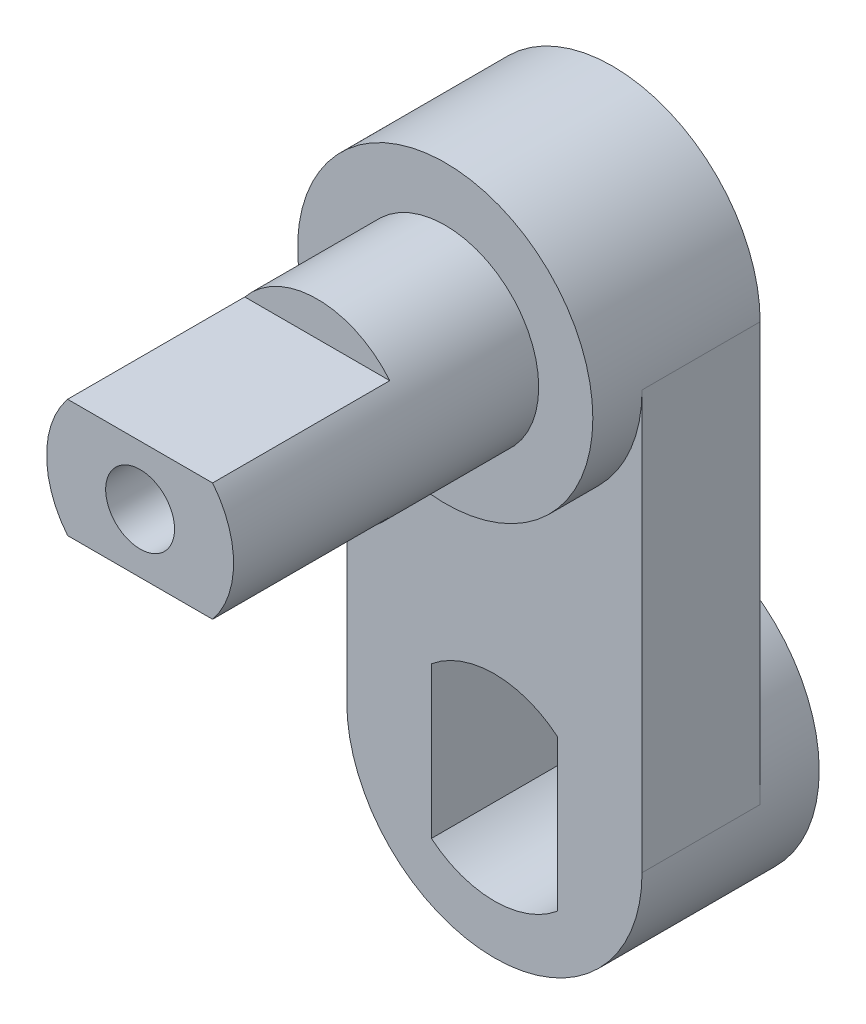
ISO-10303-21;
HEADER;
FILE_DESCRIPTION(('STEP AP214'),'2;1');
FILE_NAME('part.step','',(''),(''),'','','');
FILE_SCHEMA(('AUTOMOTIVE_DESIGN { 1 0 10303 214 1 1 1 1 }'));
ENDSEC;
DATA;
#1=APPLICATION_CONTEXT('core data for automotive mechanical design processes');
#2=APPLICATION_PROTOCOL_DEFINITION('international standard','automotive_design',2000,#1);
#3=PRODUCT_CONTEXT('',#1,'mechanical');
#4=PRODUCT('Part','Part','',(#3));
#5=PRODUCT_RELATED_PRODUCT_CATEGORY('part','',(#4));
#6=PRODUCT_DEFINITION_FORMATION('','',#4);
#7=PRODUCT_DEFINITION_CONTEXT('part definition',#1,'design');
#8=PRODUCT_DEFINITION('design','',#6,#7);
#9=PRODUCT_DEFINITION_SHAPE('','',#8);
#10=(LENGTH_UNIT() NAMED_UNIT(*) SI_UNIT(.MILLI.,.METRE.));
#11=(NAMED_UNIT(*) PLANE_ANGLE_UNIT() SI_UNIT($,.RADIAN.));
#12=(NAMED_UNIT(*) SI_UNIT($,.STERADIAN.) SOLID_ANGLE_UNIT());
#13=UNCERTAINTY_MEASURE_WITH_UNIT(LENGTH_MEASURE(1.E-05),#10,'distance_accuracy_value','');
#14=(GEOMETRIC_REPRESENTATION_CONTEXT(3) GLOBAL_UNCERTAINTY_ASSIGNED_CONTEXT((#13)) GLOBAL_UNIT_ASSIGNED_CONTEXT((#10,
#11,#12)) REPRESENTATION_CONTEXT('',''));
#15=CARTESIAN_POINT('',(0.,0.,0.));
#16=DIRECTION('',(0.,0.,1.));
#17=DIRECTION('',(1.,0.,0.));
#18=AXIS2_PLACEMENT_3D('',#15,#16,#17);
#19=CARTESIAN_POINT('',(0.,21.24,18.));
#20=DIRECTION('',(0.,0.,1.));
#21=DIRECTION('',(1.,0.,0.));
#22=AXIS2_PLACEMENT_3D('',#19,#20,#21);
#23=PLANE('',#22);
#24=CARTESIAN_POINT('',(0.,21.24,18.));
#25=DIRECTION('',(0.,0.,1.));
#26=DIRECTION('',(1.,0.,0.));
#27=AXIS2_PLACEMENT_3D('',#24,#25,#26);
#28=CIRCLE('',#27,4.75);
#29=CARTESIAN_POINT('',(3.68272996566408,24.24,18.));
#30=VERTEX_POINT('',#29);
#31=CARTESIAN_POINT('',(-3.68272996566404,24.24,18.));
#32=VERTEX_POINT('',#31);
#33=EDGE_CURVE('E58',#30,#32,#28,.T.);
#34=ORIENTED_EDGE('',*,*,#33,.T.);
#35=DIRECTION('',(1.,0.,0.));
#36=VECTOR('',#35,1.);
#37=CARTESIAN_POINT('',(1.59853088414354E-13,24.24,18.));
#38=LINE('',#37,#36);
#39=EDGE_CURVE('E144',#32,#30,#38,.T.);
#40=ORIENTED_EDGE('',*,*,#39,.T.);
#41=EDGE_LOOP('',(#34,#40));
#42=FACE_BOUND('',#41,.T.);
#43=ADVANCED_FACE('F36',(#42),#23,.T.);
#44=CARTESIAN_POINT('',(0.,0.,9.));
#45=DIRECTION('',(0.,0.,-1.));
#46=DIRECTION('',(-1.,0.,0.));
#47=AXIS2_PLACEMENT_3D('',#44,#45,#46);
#48=CYLINDRICAL_SURFACE('',#47,7.5);
#49=CARTESIAN_POINT('',(0.,0.,0.));
#50=DIRECTION('',(0.,0.,1.));
#51=DIRECTION('',(1.,0.,0.));
#52=AXIS2_PLACEMENT_3D('',#49,#50,#51);
#53=CIRCLE('',#52,7.5);
#54=CARTESIAN_POINT('',(7.5,0.,0.));
#55=VERTEX_POINT('',#54);
#56=EDGE_CURVE('E220',#55,#55,#53,.T.);
#57=ORIENTED_EDGE('',*,*,#56,.T.);
#58=EDGE_LOOP('',(#57));
#59=FACE_BOUND('',#58,.T.);
#60=CARTESIAN_POINT('',(0.,0.,3.));
#61=DIRECTION('',(0.,0.,1.));
#62=DIRECTION('',(1.,0.,0.));
#63=AXIS2_PLACEMENT_3D('',#60,#61,#62);
#64=CIRCLE('',#63,7.5);
#65=CARTESIAN_POINT('',(7.5,0.,3.));
#66=VERTEX_POINT('',#65);
#67=CARTESIAN_POINT('',(-7.5,0.,3.));
#68=VERTEX_POINT('',#67);
#69=EDGE_CURVE('E181',#66,#68,#64,.T.);
#70=ORIENTED_EDGE('',*,*,#69,.F.);
#71=DIRECTION('',(0.,0.,1.));
#72=VECTOR('',#71,1.);
#73=CARTESIAN_POINT('',(7.5,0.,3.));
#74=LINE('',#73,#72);
#75=CARTESIAN_POINT('',(7.5,0.,9.));
#76=VERTEX_POINT('',#75);
#77=EDGE_CURVE('E178',#66,#76,#74,.T.);
#78=ORIENTED_EDGE('',*,*,#77,.T.);
#79=CARTESIAN_POINT('',(0.,0.,9.));
#80=DIRECTION('',(0.,0.,1.));
#81=DIRECTION('',(1.,0.,0.));
#82=AXIS2_PLACEMENT_3D('',#79,#80,#81);
#83=CIRCLE('',#82,7.5);
#84=CARTESIAN_POINT('',(-7.5,0.,9.));
#85=VERTEX_POINT('',#84);
#86=EDGE_CURVE('E165',#85,#76,#83,.T.);
#87=ORIENTED_EDGE('',*,*,#86,.F.);
#88=DIRECTION('',(0.,0.,1.));
#89=VECTOR('',#88,1.);
#90=CARTESIAN_POINT('',(-7.5,0.,3.));
#91=LINE('',#90,#89);
#92=EDGE_CURVE('E182',#68,#85,#91,.T.);
#93=ORIENTED_EDGE('',*,*,#92,.F.);
#94=EDGE_LOOP('',(#70,#78,#87,#93));
#95=FACE_BOUND('',#94,.T.);
#96=ADVANCED_FACE('F240',(#59,#95),#48,.T.);
#97=CARTESIAN_POINT('',(0.,0.,9.));
#98=DIRECTION('',(0.,0.,1.));
#99=DIRECTION('',(1.,0.,0.));
#100=AXIS2_PLACEMENT_3D('',#97,#98,#99);
#101=PLANE('',#100);
#102=CARTESIAN_POINT('',(0.,21.24,9.));
#103=DIRECTION('',(0.,0.,1.));
#104=DIRECTION('',(1.,0.,0.));
#105=AXIS2_PLACEMENT_3D('',#102,#103,#104);
#106=CIRCLE('',#105,7.5);
#107=CARTESIAN_POINT('',(-7.5,21.24,9.));
#108=VERTEX_POINT('',#107);
#109=CARTESIAN_POINT('',(7.5,21.24,9.));
#110=VERTEX_POINT('',#109);
#111=EDGE_CURVE('E159',#108,#110,#106,.T.);
#112=ORIENTED_EDGE('',*,*,#111,.F.);
#113=DIRECTION('',(0.,-1.,0.));
#114=VECTOR('',#113,1.);
#115=CARTESIAN_POINT('',(-7.5,0.,9.));
#116=LINE('',#115,#114);
#117=EDGE_CURVE('E169',#108,#85,#116,.T.);
#118=ORIENTED_EDGE('',*,*,#117,.T.);
#119=ORIENTED_EDGE('',*,*,#86,.T.);
#120=DIRECTION('',(0.,-1.,0.));
#121=VECTOR('',#120,1.);
#122=CARTESIAN_POINT('',(7.5,0.,9.));
#123=LINE('',#122,#121);
#124=EDGE_CURVE('E162',#110,#76,#123,.T.);
#125=ORIENTED_EDGE('',*,*,#124,.F.);
#126=EDGE_LOOP('',(#112,#118,#119,#125));
#127=FACE_BOUND('',#126,.T.);
#128=CARTESIAN_POINT('',(0.,0.,9.));
#129=DIRECTION('',(0.,0.,1.));
#130=DIRECTION('',(1.,0.,0.));
#131=AXIS2_PLACEMENT_3D('',#128,#129,#130);
#132=CIRCLE('',#131,5.);
#133=CARTESIAN_POINT('',(3.2,3.84187454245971,9.));
#134=VERTEX_POINT('',#133);
#135=CARTESIAN_POINT('',(-3.2,3.84187454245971,9.));
#136=VERTEX_POINT('',#135);
#137=EDGE_CURVE('E194',#134,#136,#132,.T.);
#138=ORIENTED_EDGE('',*,*,#137,.F.);
#139=DIRECTION('',(0.,1.,0.));
#140=VECTOR('',#139,1.);
#141=CARTESIAN_POINT('',(3.2,0.,9.));
#142=LINE('',#141,#140);
#143=CARTESIAN_POINT('',(3.2,-3.84187454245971,9.));
#144=VERTEX_POINT('',#143);
#145=EDGE_CURVE('E192',#144,#134,#142,.T.);
#146=ORIENTED_EDGE('',*,*,#145,.F.);
#147=CARTESIAN_POINT('',(0.,0.,9.));
#148=DIRECTION('',(0.,0.,1.));
#149=DIRECTION('',(1.,0.,0.));
#150=AXIS2_PLACEMENT_3D('',#147,#148,#149);
#151=CIRCLE('',#150,5.);
#152=CARTESIAN_POINT('',(-3.2,-3.84187454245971,9.));
#153=VERTEX_POINT('',#152);
#154=EDGE_CURVE('E200',#153,#144,#151,.T.);
#155=ORIENTED_EDGE('',*,*,#154,.F.);
#156=DIRECTION('',(0.,-1.,0.));
#157=VECTOR('',#156,1.);
#158=CARTESIAN_POINT('',(-3.2,0.,9.));
#159=LINE('',#158,#157);
#160=EDGE_CURVE('E197',#136,#153,#159,.T.);
#161=ORIENTED_EDGE('',*,*,#160,.F.);
#162=EDGE_LOOP('',(#138,#146,#155,#161));
#163=FACE_BOUND('',#162,.T.);
#164=ADVANCED_FACE('F246',(#127,#163),#101,.T.);
#165=CARTESIAN_POINT('',(0.,0.,0.));
#166=DIRECTION('',(0.,0.,1.));
#167=DIRECTION('',(1.,0.,0.));
#168=AXIS2_PLACEMENT_3D('',#165,#166,#167);
#169=PLANE('',#168);
#170=ORIENTED_EDGE('',*,*,#56,.F.);
#171=EDGE_LOOP('',(#170));
#172=FACE_BOUND('',#171,.T.);
#173=DIRECTION('',(0.,1.,0.));
#174=VECTOR('',#173,1.);
#175=CARTESIAN_POINT('',(3.2,0.,0.));
#176=LINE('',#175,#174);
#177=CARTESIAN_POINT('',(3.2,-3.84187454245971,0.));
#178=VERTEX_POINT('',#177);
#179=CARTESIAN_POINT('',(3.2,3.84187454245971,0.));
#180=VERTEX_POINT('',#179);
#181=EDGE_CURVE('E191',#178,#180,#176,.T.);
#182=ORIENTED_EDGE('',*,*,#181,.T.);
#183=CARTESIAN_POINT('',(0.,0.,0.));
#184=DIRECTION('',(0.,0.,1.));
#185=DIRECTION('',(1.,0.,0.));
#186=AXIS2_PLACEMENT_3D('',#183,#184,#185);
#187=CIRCLE('',#186,5.);
#188=CARTESIAN_POINT('',(-3.2,3.84187454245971,0.));
#189=VERTEX_POINT('',#188);
#190=EDGE_CURVE('E205',#180,#189,#187,.T.);
#191=ORIENTED_EDGE('',*,*,#190,.T.);
#192=DIRECTION('',(0.,-1.,0.));
#193=VECTOR('',#192,1.);
#194=CARTESIAN_POINT('',(-3.2,0.,0.));
#195=LINE('',#194,#193);
#196=CARTESIAN_POINT('',(-3.2,-3.84187454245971,0.));
#197=VERTEX_POINT('',#196);
#198=EDGE_CURVE('E208',#189,#197,#195,.T.);
#199=ORIENTED_EDGE('',*,*,#198,.T.);
#200=CARTESIAN_POINT('',(0.,0.,0.));
#201=DIRECTION('',(0.,0.,1.));
#202=DIRECTION('',(1.,0.,0.));
#203=AXIS2_PLACEMENT_3D('',#200,#201,#202);
#204=CIRCLE('',#203,5.);
#205=EDGE_CURVE('E195',#197,#178,#204,.T.);
#206=ORIENTED_EDGE('',*,*,#205,.T.);
#207=EDGE_LOOP('',(#182,#191,#199,#206));
#208=FACE_BOUND('',#207,.T.);
#209=ADVANCED_FACE('F292',(#172,#208),#169,.F.);
#210=CARTESIAN_POINT('',(3.2,0.,9.));
#211=DIRECTION('',(-1.,0.,0.));
#212=DIRECTION('',(0.,-1.,0.));
#213=AXIS2_PLACEMENT_3D('',#210,#211,#212);
#214=PLANE('',#213);
#215=DIRECTION('',(0.,0.,-1.));
#216=VECTOR('',#215,1.);
#217=CARTESIAN_POINT('',(3.2,3.84187454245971,9.));
#218=LINE('',#217,#216);
#219=EDGE_CURVE('E218',#134,#180,#218,.T.);
#220=ORIENTED_EDGE('',*,*,#219,.T.);
#221=ORIENTED_EDGE('',*,*,#181,.F.);
#222=DIRECTION('',(0.,0.,-1.));
#223=VECTOR('',#222,1.);
#224=CARTESIAN_POINT('',(3.2,-3.84187454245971,9.));
#225=LINE('',#224,#223);
#226=EDGE_CURVE('E202',#144,#178,#225,.T.);
#227=ORIENTED_EDGE('',*,*,#226,.F.);
#228=ORIENTED_EDGE('',*,*,#145,.T.);
#229=EDGE_LOOP('',(#220,#221,#227,#228));
#230=FACE_BOUND('',#229,.T.);
#231=ADVANCED_FACE('F288',(#230),#214,.T.);
#232=CARTESIAN_POINT('',(0.,0.,9.));
#233=DIRECTION('',(0.,0.,-1.));
#234=DIRECTION('',(-1.,0.,0.));
#235=AXIS2_PLACEMENT_3D('',#232,#233,#234);
#236=CYLINDRICAL_SURFACE('',#235,5.);
#237=DIRECTION('',(0.,0.,-1.));
#238=VECTOR('',#237,1.);
#239=CARTESIAN_POINT('',(-3.2,3.84187454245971,9.));
#240=LINE('',#239,#238);
#241=EDGE_CURVE('E216',#136,#189,#240,.T.);
#242=ORIENTED_EDGE('',*,*,#241,.T.);
#243=ORIENTED_EDGE('',*,*,#190,.F.);
#244=ORIENTED_EDGE('',*,*,#219,.F.);
#245=ORIENTED_EDGE('',*,*,#137,.T.);
#246=EDGE_LOOP('',(#242,#243,#244,#245));
#247=FACE_BOUND('',#246,.T.);
#248=ADVANCED_FACE('F284',(#247),#236,.F.);
#249=CARTESIAN_POINT('',(-3.2,0.,9.));
#250=DIRECTION('',(1.,0.,0.));
#251=DIRECTION('',(0.,1.,0.));
#252=AXIS2_PLACEMENT_3D('',#249,#250,#251);
#253=PLANE('',#252);
#254=DIRECTION('',(0.,0.,-1.));
#255=VECTOR('',#254,1.);
#256=CARTESIAN_POINT('',(-3.2,-3.84187454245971,9.));
#257=LINE('',#256,#255);
#258=EDGE_CURVE('E214',#153,#197,#257,.T.);
#259=ORIENTED_EDGE('',*,*,#258,.T.);
#260=ORIENTED_EDGE('',*,*,#198,.F.);
#261=ORIENTED_EDGE('',*,*,#241,.F.);
#262=ORIENTED_EDGE('',*,*,#160,.T.);
#263=EDGE_LOOP('',(#259,#260,#261,#262));
#264=FACE_BOUND('',#263,.T.);
#265=ADVANCED_FACE('F280',(#264),#253,.T.);
#266=CARTESIAN_POINT('',(0.,0.,9.));
#267=DIRECTION('',(0.,0.,-1.));
#268=DIRECTION('',(-1.,0.,0.));
#269=AXIS2_PLACEMENT_3D('',#266,#267,#268);
#270=CYLINDRICAL_SURFACE('',#269,5.);
#271=ORIENTED_EDGE('',*,*,#226,.T.);
#272=ORIENTED_EDGE('',*,*,#205,.F.);
#273=ORIENTED_EDGE('',*,*,#258,.F.);
#274=ORIENTED_EDGE('',*,*,#154,.T.);
#275=EDGE_LOOP('',(#271,#272,#273,#274));
#276=FACE_BOUND('',#275,.T.);
#277=ADVANCED_FACE('F276',(#276),#270,.F.);
#278=CARTESIAN_POINT('',(7.5,0.,3.));
#279=DIRECTION('',(-1.,0.,0.));
#280=DIRECTION('',(0.,0.,1.));
#281=AXIS2_PLACEMENT_3D('',#278,#279,#280);
#282=PLANE('',#281);
#283=ORIENTED_EDGE('',*,*,#124,.T.);
#284=ORIENTED_EDGE('',*,*,#77,.F.);
#285=DIRECTION('',(0.,-1.,0.));
#286=VECTOR('',#285,1.);
#287=CARTESIAN_POINT('',(7.5,0.,3.));
#288=LINE('',#287,#286);
#289=CARTESIAN_POINT('',(7.5,21.24,3.));
#290=VERTEX_POINT('',#289);
#291=EDGE_CURVE('E166',#290,#66,#288,.T.);
#292=ORIENTED_EDGE('',*,*,#291,.F.);
#293=DIRECTION('',(0.,0.,1.));
#294=VECTOR('',#293,1.);
#295=CARTESIAN_POINT('',(7.5,21.24,3.));
#296=LINE('',#295,#294);
#297=EDGE_CURVE('E175',#290,#110,#296,.T.);
#298=ORIENTED_EDGE('',*,*,#297,.T.);
#299=EDGE_LOOP('',(#283,#284,#292,#298));
#300=FACE_BOUND('',#299,.T.);
#301=ADVANCED_FACE('F269',(#300),#282,.F.);
#302=CARTESIAN_POINT('',(-7.5,0.,3.));
#303=DIRECTION('',(-1.,0.,0.));
#304=DIRECTION('',(0.,0.,1.));
#305=AXIS2_PLACEMENT_3D('',#302,#303,#304);
#306=PLANE('',#305);
#307=ORIENTED_EDGE('',*,*,#117,.F.);
#308=DIRECTION('',(0.,0.,1.));
#309=VECTOR('',#308,1.);
#310=CARTESIAN_POINT('',(-7.5,21.24,3.));
#311=LINE('',#310,#309);
#312=CARTESIAN_POINT('',(-7.5,21.24,3.));
#313=VERTEX_POINT('',#312);
#314=EDGE_CURVE('E185',#313,#108,#311,.T.);
#315=ORIENTED_EDGE('',*,*,#314,.F.);
#316=DIRECTION('',(0.,-1.,0.));
#317=VECTOR('',#316,1.);
#318=CARTESIAN_POINT('',(-7.5,0.,3.));
#319=LINE('',#318,#317);
#320=EDGE_CURVE('E172',#313,#68,#319,.T.);
#321=ORIENTED_EDGE('',*,*,#320,.T.);
#322=ORIENTED_EDGE('',*,*,#92,.T.);
#323=EDGE_LOOP('',(#307,#315,#321,#322));
#324=FACE_BOUND('',#323,.T.);
#325=ADVANCED_FACE('F266',(#324),#306,.T.);
#326=CARTESIAN_POINT('',(0.,21.24,3.));
#327=DIRECTION('',(0.,0.,1.));
#328=DIRECTION('',(1.,0.,0.));
#329=AXIS2_PLACEMENT_3D('',#326,#327,#328);
#330=CYLINDRICAL_SURFACE('',#329,7.5);
#331=ORIENTED_EDGE('',*,*,#314,.T.);
#332=ORIENTED_EDGE('',*,*,#111,.T.);
#333=ORIENTED_EDGE('',*,*,#297,.F.);
#334=CARTESIAN_POINT('',(0.,21.24,3.));
#335=DIRECTION('',(0.,0.,1.));
#336=DIRECTION('',(1.,0.,0.));
#337=AXIS2_PLACEMENT_3D('',#334,#335,#336);
#338=CIRCLE('',#337,7.5);
#339=EDGE_CURVE('E168',#290,#313,#338,.T.);
#340=ORIENTED_EDGE('',*,*,#339,.T.);
#341=EDGE_LOOP('',(#331,#332,#333,#340));
#342=FACE_BOUND('',#341,.T.);
#343=CARTESIAN_POINT('',(0.,21.24,11.5));
#344=DIRECTION('',(0.,0.,1.));
#345=DIRECTION('',(1.,0.,0.));
#346=AXIS2_PLACEMENT_3D('',#343,#344,#345);
#347=CIRCLE('',#346,7.5);
#348=CARTESIAN_POINT('',(7.5,21.24,11.5));
#349=VERTEX_POINT('',#348);
#350=EDGE_CURVE('E155',#349,#349,#347,.T.);
#351=ORIENTED_EDGE('',*,*,#350,.F.);
#352=EDGE_LOOP('',(#351));
#353=FACE_BOUND('',#352,.T.);
#354=ADVANCED_FACE('F265',(#342,#353),#330,.T.);
#355=CARTESIAN_POINT('',(0.,0.,3.));
#356=DIRECTION('',(0.,0.,1.));
#357=DIRECTION('',(1.,0.,0.));
#358=AXIS2_PLACEMENT_3D('',#355,#356,#357);
#359=PLANE('',#358);
#360=CARTESIAN_POINT('',(0.,21.24,3.));
#361=DIRECTION('',(0.,0.,1.));
#362=DIRECTION('',(1.,0.,0.));
#363=AXIS2_PLACEMENT_3D('',#360,#361,#362);
#364=CIRCLE('',#363,3.25);
#365=CARTESIAN_POINT('',(-3.25,21.24,3.));
#366=VERTEX_POINT('',#365);
#367=EDGE_CURVE('E45',#366,#366,#364,.T.);
#368=ORIENTED_EDGE('',*,*,#367,.T.);
#369=EDGE_LOOP('',(#368));
#370=FACE_BOUND('',#369,.T.);
#371=ORIENTED_EDGE('',*,*,#291,.T.);
#372=ORIENTED_EDGE('',*,*,#69,.T.);
#373=ORIENTED_EDGE('',*,*,#320,.F.);
#374=ORIENTED_EDGE('',*,*,#339,.F.);
#375=EDGE_LOOP('',(#371,#372,#373,#374));
#376=FACE_BOUND('',#375,.T.);
#377=ADVANCED_FACE('F227',(#370,#376),#359,.F.);
#378=CARTESIAN_POINT('',(0.,21.24,11.5));
#379=DIRECTION('',(0.,0.,1.));
#380=DIRECTION('',(1.,0.,0.));
#381=AXIS2_PLACEMENT_3D('',#378,#379,#380);
#382=PLANE('',#381);
#383=CARTESIAN_POINT('',(0.,21.24,11.5));
#384=DIRECTION('',(0.,0.,1.));
#385=DIRECTION('',(1.,0.,0.));
#386=AXIS2_PLACEMENT_3D('',#383,#384,#385);
#387=CIRCLE('',#386,4.75);
#388=CARTESIAN_POINT('',(4.75,21.24,11.5));
#389=VERTEX_POINT('',#388);
#390=EDGE_CURVE('E156',#389,#389,#387,.T.);
#391=ORIENTED_EDGE('',*,*,#390,.F.);
#392=EDGE_LOOP('',(#391));
#393=FACE_BOUND('',#392,.T.);
#394=ORIENTED_EDGE('',*,*,#350,.T.);
#395=EDGE_LOOP('',(#394));
#396=FACE_BOUND('',#395,.T.);
#397=ADVANCED_FACE('F256',(#393,#396),#382,.T.);
#398=CARTESIAN_POINT('',(0.,21.24,18.));
#399=DIRECTION('',(0.,0.,-1.));
#400=DIRECTION('',(-1.,0.,0.));
#401=AXIS2_PLACEMENT_3D('',#398,#399,#400);
#402=CYLINDRICAL_SURFACE('',#401,4.75);
#403=ORIENTED_EDGE('',*,*,#33,.F.);
#404=DIRECTION('',(0.,0.,-1.));
#405=VECTOR('',#404,1.);
#406=CARTESIAN_POINT('',(3.68272996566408,24.24,27.));
#407=LINE('',#406,#405);
#408=CARTESIAN_POINT('',(3.68272996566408,24.24,27.));
#409=VERTEX_POINT('',#408);
#410=EDGE_CURVE('E151',#409,#30,#407,.T.);
#411=ORIENTED_EDGE('',*,*,#410,.F.);
#412=CARTESIAN_POINT('',(0.,21.24,27.));
#413=DIRECTION('',(0.,0.,1.));
#414=DIRECTION('',(1.,0.,0.));
#415=AXIS2_PLACEMENT_3D('',#412,#413,#414);
#416=CIRCLE('',#415,4.75);
#417=CARTESIAN_POINT('',(3.68272996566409,18.24,27.));
#418=VERTEX_POINT('',#417);
#419=EDGE_CURVE('E135',#418,#409,#416,.T.);
#420=ORIENTED_EDGE('',*,*,#419,.F.);
#421=DIRECTION('',(0.,0.,-1.));
#422=VECTOR('',#421,1.);
#423=CARTESIAN_POINT('',(3.68272996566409,18.24,27.));
#424=LINE('',#423,#422);
#425=CARTESIAN_POINT('',(3.68272996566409,18.24,18.));
#426=VERTEX_POINT('',#425);
#427=EDGE_CURVE('E132',#418,#426,#424,.T.);
#428=ORIENTED_EDGE('',*,*,#427,.T.);
#429=CARTESIAN_POINT('',(-3.68272996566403,18.24,18.));
#430=VERTEX_POINT('',#429);
#431=EDGE_CURVE('E148',#430,#426,#28,.T.);
#432=ORIENTED_EDGE('',*,*,#431,.F.);
#433=DIRECTION('',(0.,0.,-1.));
#434=VECTOR('',#433,1.);
#435=CARTESIAN_POINT('',(-3.68272996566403,18.24,27.));
#436=LINE('',#435,#434);
#437=CARTESIAN_POINT('',(-3.68272996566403,18.24,27.));
#438=VERTEX_POINT('',#437);
#439=EDGE_CURVE('E130',#438,#430,#436,.T.);
#440=ORIENTED_EDGE('',*,*,#439,.F.);
#441=CARTESIAN_POINT('',(0.,21.24,27.));
#442=DIRECTION('',(0.,0.,1.));
#443=DIRECTION('',(1.,0.,0.));
#444=AXIS2_PLACEMENT_3D('',#441,#442,#443);
#445=CIRCLE('',#444,4.75);
#446=CARTESIAN_POINT('',(-3.68272996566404,24.24,27.));
#447=VERTEX_POINT('',#446);
#448=EDGE_CURVE('E136',#447,#438,#445,.T.);
#449=ORIENTED_EDGE('',*,*,#448,.F.);
#450=DIRECTION('',(0.,0.,-1.));
#451=VECTOR('',#450,1.);
#452=CARTESIAN_POINT('',(-3.68272996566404,24.24,27.));
#453=LINE('',#452,#451);
#454=EDGE_CURVE('E437',#447,#32,#453,.T.);
#455=ORIENTED_EDGE('',*,*,#454,.T.);
#456=EDGE_LOOP('',(#403,#411,#420,#428,#432,#440,#449,#455));
#457=FACE_BOUND('',#456,.T.);
#458=ORIENTED_EDGE('',*,*,#390,.T.);
#459=EDGE_LOOP('',(#458));
#460=FACE_BOUND('',#459,.T.);
#461=ADVANCED_FACE('F146',(#457,#460),#402,.T.);
#462=DIRECTION('',(1.,0.,0.));
#463=VECTOR('',#462,1.);
#464=CARTESIAN_POINT('',(-1.71836417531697E-13,18.24,18.));
#465=LINE('',#464,#463);
#466=EDGE_CURVE('E51',#430,#426,#465,.T.);
#467=ORIENTED_EDGE('',*,*,#466,.F.);
#468=ORIENTED_EDGE('',*,*,#431,.T.);
#469=EDGE_LOOP('',(#467,#468));
#470=FACE_BOUND('',#469,.T.);
#471=ADVANCED_FACE('F242',(#470),#23,.T.);
#472=CARTESIAN_POINT('',(-1.71836417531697E-13,18.24,27.));
#473=DIRECTION('',(0.,1.,0.));
#474=DIRECTION('',(-1.,0.,0.));
#475=AXIS2_PLACEMENT_3D('',#472,#473,#474);
#476=PLANE('',#475);
#477=ORIENTED_EDGE('',*,*,#466,.T.);
#478=ORIENTED_EDGE('',*,*,#427,.F.);
#479=DIRECTION('',(1.,0.,0.));
#480=VECTOR('',#479,1.);
#481=CARTESIAN_POINT('',(-1.71836417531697E-13,18.24,27.));
#482=LINE('',#481,#480);
#483=EDGE_CURVE('E126',#438,#418,#482,.T.);
#484=ORIENTED_EDGE('',*,*,#483,.F.);
#485=ORIENTED_EDGE('',*,*,#439,.T.);
#486=EDGE_LOOP('',(#477,#478,#484,#485));
#487=FACE_BOUND('',#486,.T.);
#488=ADVANCED_FACE('F128',(#487),#476,.F.);
#489=CARTESIAN_POINT('',(1.59853088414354E-13,24.24,27.));
#490=DIRECTION('',(0.,1.,0.));
#491=DIRECTION('',(-1.,0.,0.));
#492=AXIS2_PLACEMENT_3D('',#489,#490,#491);
#493=PLANE('',#492);
#494=ORIENTED_EDGE('',*,*,#39,.F.);
#495=ORIENTED_EDGE('',*,*,#454,.F.);
#496=DIRECTION('',(1.,0.,0.));
#497=VECTOR('',#496,1.);
#498=CARTESIAN_POINT('',(1.59853088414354E-13,24.24,27.));
#499=LINE('',#498,#497);
#500=EDGE_CURVE('E142',#447,#409,#499,.T.);
#501=ORIENTED_EDGE('',*,*,#500,.T.);
#502=ORIENTED_EDGE('',*,*,#410,.T.);
#503=EDGE_LOOP('',(#494,#495,#501,#502));
#504=FACE_BOUND('',#503,.T.);
#505=ADVANCED_FACE('F255',(#504),#493,.T.);
#506=CARTESIAN_POINT('',(0.,0.,27.));
#507=DIRECTION('',(0.,0.,1.));
#508=DIRECTION('',(1.,0.,0.));
#509=AXIS2_PLACEMENT_3D('',#506,#507,#508);
#510=PLANE('',#509);
#511=CARTESIAN_POINT('',(0.,21.24,27.));
#512=DIRECTION('',(0.,0.,1.));
#513=DIRECTION('',(1.,0.,0.));
#514=AXIS2_PLACEMENT_3D('',#511,#512,#513);
#515=CIRCLE('',#514,1.75);
#516=CARTESIAN_POINT('',(1.75,21.24,27.));
#517=VERTEX_POINT('',#516);
#518=EDGE_CURVE('E431',#517,#517,#515,.T.);
#519=ORIENTED_EDGE('',*,*,#518,.F.);
#520=EDGE_LOOP('',(#519));
#521=FACE_BOUND('',#520,.T.);
#522=ORIENTED_EDGE('',*,*,#448,.T.);
#523=ORIENTED_EDGE('',*,*,#483,.T.);
#524=ORIENTED_EDGE('',*,*,#419,.T.);
#525=ORIENTED_EDGE('',*,*,#500,.F.);
#526=EDGE_LOOP('',(#522,#523,#524,#525));
#527=FACE_BOUND('',#526,.T.);
#528=ADVANCED_FACE('F140',(#521,#527),#510,.T.);
#529=CARTESIAN_POINT('',(0.,21.24,-10.));
#530=DIRECTION('',(0.,0.,1.));
#531=DIRECTION('',(1.,0.,0.));
#532=AXIS2_PLACEMENT_3D('',#529,#530,#531);
#533=CYLINDRICAL_SURFACE('',#532,1.75);
#534=CARTESIAN_POINT('',(0.,21.24,4.5));
#535=DIRECTION('',(0.,0.,1.));
#536=DIRECTION('',(1.,0.,0.));
#537=AXIS2_PLACEMENT_3D('',#534,#535,#536);
#538=CIRCLE('',#537,1.75);
#539=CARTESIAN_POINT('',(-1.75,21.24,4.5));
#540=VERTEX_POINT('',#539);
#541=EDGE_CURVE('E11',#540,#540,#538,.F.);
#542=ORIENTED_EDGE('',*,*,#541,.T.);
#543=EDGE_LOOP('',(#542));
#544=FACE_BOUND('',#543,.T.);
#545=ORIENTED_EDGE('',*,*,#518,.T.);
#546=EDGE_LOOP('',(#545));
#547=FACE_BOUND('',#546,.T.);
#548=ADVANCED_FACE('F231',(#544,#547),#533,.F.);
#549=CARTESIAN_POINT('',(0.,21.24,3.));
#550=DIRECTION('',(0.,0.,-1.));
#551=DIRECTION('',(-1.,0.,0.));
#552=AXIS2_PLACEMENT_3D('',#549,#550,#551);
#553=CONICAL_SURFACE('',#552,3.25,0.785398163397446);
#554=CARTESIAN_POINT('',(-1.75,21.24,4.5));
#555=CARTESIAN_POINT('',(-1.765625,21.24,4.484375));
#556=CARTESIAN_POINT('',(-1.78125,21.24,4.46875));
#557=CARTESIAN_POINT('',(-1.8125,21.24,4.4375));
#558=CARTESIAN_POINT('',(-1.828125,21.24,4.421875));
#559=CARTESIAN_POINT('',(-1.859375,21.24,4.390625));
#560=CARTESIAN_POINT('',(-1.875,21.24,4.375));
#561=CARTESIAN_POINT('',(-1.90625,21.24,4.34375));
#562=CARTESIAN_POINT('',(-1.921875,21.24,4.328125));
#563=CARTESIAN_POINT('',(-1.953125,21.24,4.296875));
#564=CARTESIAN_POINT('',(-1.96875,21.24,4.28125));
#565=CARTESIAN_POINT('',(-2.,21.24,4.25));
#566=CARTESIAN_POINT('',(-2.015625,21.24,4.234375));
#567=CARTESIAN_POINT('',(-2.046875,21.24,4.203125));
#568=CARTESIAN_POINT('',(-2.0625,21.24,4.1875));
#569=CARTESIAN_POINT('',(-2.09375,21.24,4.15625));
#570=CARTESIAN_POINT('',(-2.109375,21.24,4.140625));
#571=CARTESIAN_POINT('',(-2.140625,21.24,4.109375));
#572=CARTESIAN_POINT('',(-2.15625,21.24,4.09375));
#573=CARTESIAN_POINT('',(-2.1875,21.24,4.0625));
#574=CARTESIAN_POINT('',(-2.203125,21.24,4.046875));
#575=CARTESIAN_POINT('',(-2.234375,21.24,4.015625));
#576=CARTESIAN_POINT('',(-2.25,21.24,4.));
#577=CARTESIAN_POINT('',(-2.28125,21.24,3.96875));
#578=CARTESIAN_POINT('',(-2.296875,21.24,3.953125));
#579=CARTESIAN_POINT('',(-2.328125,21.24,3.921875));
#580=CARTESIAN_POINT('',(-2.34375,21.24,3.90625));
#581=CARTESIAN_POINT('',(-2.375,21.24,3.875));
#582=CARTESIAN_POINT('',(-2.390625,21.24,3.859375));
#583=CARTESIAN_POINT('',(-2.421875,21.24,3.828125));
#584=CARTESIAN_POINT('',(-2.4375,21.24,3.8125));
#585=CARTESIAN_POINT('',(-2.46875,21.24,3.78125));
#586=CARTESIAN_POINT('',(-2.484375,21.24,3.765625));
#587=CARTESIAN_POINT('',(-2.515625,21.24,3.734375));
#588=CARTESIAN_POINT('',(-2.53125,21.24,3.71875));
#589=CARTESIAN_POINT('',(-2.5625,21.24,3.6875));
#590=CARTESIAN_POINT('',(-2.578125,21.24,3.671875));
#591=CARTESIAN_POINT('',(-2.609375,21.24,3.640625));
#592=CARTESIAN_POINT('',(-2.625,21.24,3.625));
#593=CARTESIAN_POINT('',(-2.65625,21.24,3.59375));
#594=CARTESIAN_POINT('',(-2.671875,21.24,3.578125));
#595=CARTESIAN_POINT('',(-2.703125,21.24,3.546875));
#596=CARTESIAN_POINT('',(-2.71875,21.24,3.53125));
#597=CARTESIAN_POINT('',(-2.75,21.24,3.5));
#598=CARTESIAN_POINT('',(-2.765625,21.24,3.484375));
#599=CARTESIAN_POINT('',(-2.796875,21.24,3.453125));
#600=CARTESIAN_POINT('',(-2.8125,21.24,3.4375));
#601=CARTESIAN_POINT('',(-2.84375,21.24,3.40625));
#602=CARTESIAN_POINT('',(-2.859375,21.24,3.390625));
#603=CARTESIAN_POINT('',(-2.890625,21.24,3.359375));
#604=CARTESIAN_POINT('',(-2.90625,21.24,3.34375));
#605=CARTESIAN_POINT('',(-2.9375,21.24,3.3125));
#606=CARTESIAN_POINT('',(-2.953125,21.24,3.296875));
#607=CARTESIAN_POINT('',(-2.984375,21.24,3.265625));
#608=CARTESIAN_POINT('',(-3.,21.24,3.25));
#609=CARTESIAN_POINT('',(-3.03125,21.24,3.21875));
#610=CARTESIAN_POINT('',(-3.046875,21.24,3.203125));
#611=CARTESIAN_POINT('',(-3.078125,21.24,3.171875));
#612=CARTESIAN_POINT('',(-3.09375,21.24,3.15625));
#613=CARTESIAN_POINT('',(-3.125,21.24,3.125));
#614=CARTESIAN_POINT('',(-3.140625,21.24,3.109375));
#615=CARTESIAN_POINT('',(-3.171875,21.24,3.078125));
#616=CARTESIAN_POINT('',(-3.1875,21.24,3.0625));
#617=CARTESIAN_POINT('',(-3.21875,21.24,3.03125));
#618=CARTESIAN_POINT('',(-3.234375,21.24,3.015625));
#619=CARTESIAN_POINT('',(-3.25,21.24,3.));
#620=B_SPLINE_CURVE_WITH_KNOTS('',3,(#554,#555,#556,#557,#558,#559,#560,#561,#562,#563,#564,
#565,#566,#567,#568,#569,#570,#571,#572,#573,#574,#575,#576,#577,#578,#579,#580,#581,#582,#583,
#584,#585,#586,#587,#588,#589,#590,#591,#592,#593,#594,#595,#596,#597,#598,#599,#600,#601,#602,
#603,#604,#605,#606,#607,#608,#609,#610,#611,#612,#613,#614,#615,#616,#617,#618,#619),
.UNSPECIFIED.,.F.,.F.,(4,2,2,2,2,2,2,2,2,2,2,2,2,2,2,2,2,2,2,2,2,2,2,2,2,2,2,2,2,2,2,2,4),(0.,
0.0662912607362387,0.132582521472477,0.198873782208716,0.265165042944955,0.331456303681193,
0.397747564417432,0.464038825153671,0.53033008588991,0.596621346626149,0.662912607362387,
0.729203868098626,0.795495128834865,0.861786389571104,0.928077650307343,0.994368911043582,
1.06066017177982,1.12695143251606,1.1932426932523,1.25953395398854,1.32582521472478,
1.39211647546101,1.45840773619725,1.52469899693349,1.59099025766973,1.65728151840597,
1.72357277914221,1.78986403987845,1.85615530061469,1.92244656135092,1.98873782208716,
2.0550290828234,2.12132034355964),.UNSPECIFIED.);
#621=EDGE_CURVE('BSEAM39',#540,#366,#620,.T.);
#622=ORIENTED_EDGE('',*,*,#541,.F.);
#623=ORIENTED_EDGE('',*,*,#367,.F.);
#624=ORIENTED_EDGE('',*,*,#621,.T.);
#625=ORIENTED_EDGE('',*,*,#621,.F.);
#626=EDGE_LOOP('',(#622,#624,#623,#625));
#627=FACE_BOUND('',#626,.T.);
#628=ADVANCED_FACE('F39',(#627),#553,.F.);
#629=CLOSED_SHELL('',(#43,#96,#164,#209,#231,#248,#265,#277,#301,#325,#354,#377,#397,#461,#471,
#488,#505,#528,#548,#628));
#630=MANIFOLD_SOLID_BREP('B2',#629);
#631=ADVANCED_BREP_SHAPE_REPRESENTATION('',(#18,#630),#14);
#632=SHAPE_DEFINITION_REPRESENTATION(#9,#631);
ENDSEC;
END-ISO-10303-21;
